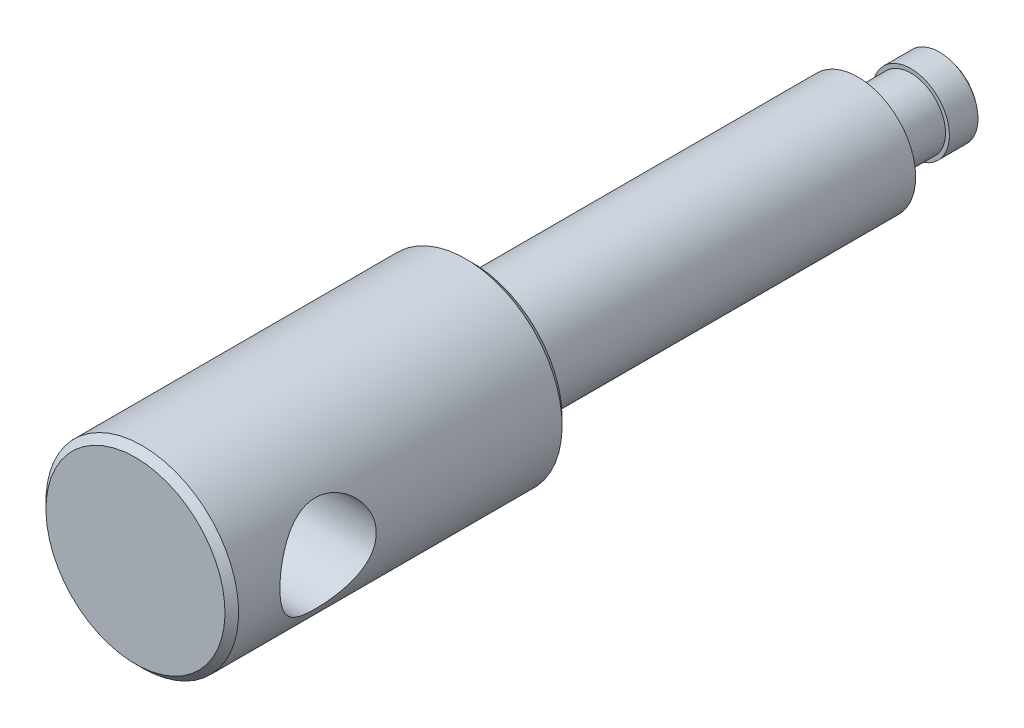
ISO-10303-21;
HEADER;
FILE_DESCRIPTION(('STEP AP214'),'2;1');
FILE_NAME('part.step','',(''),(''),'','','');
FILE_SCHEMA(('AUTOMOTIVE_DESIGN { 1 0 10303 214 1 1 1 1 }'));
ENDSEC;
DATA;
#1=APPLICATION_CONTEXT('core data for automotive mechanical design processes');
#2=APPLICATION_PROTOCOL_DEFINITION('international standard','automotive_design',2000,#1);
#3=PRODUCT_CONTEXT('',#1,'mechanical');
#4=PRODUCT('Part','Part','',(#3));
#5=PRODUCT_RELATED_PRODUCT_CATEGORY('part','',(#4));
#6=PRODUCT_DEFINITION_FORMATION('','',#4);
#7=PRODUCT_DEFINITION_CONTEXT('part definition',#1,'design');
#8=PRODUCT_DEFINITION('design','',#6,#7);
#9=PRODUCT_DEFINITION_SHAPE('','',#8);
#10=(LENGTH_UNIT() NAMED_UNIT(*) SI_UNIT(.MILLI.,.METRE.));
#11=(NAMED_UNIT(*) PLANE_ANGLE_UNIT() SI_UNIT($,.RADIAN.));
#12=(NAMED_UNIT(*) SI_UNIT($,.STERADIAN.) SOLID_ANGLE_UNIT());
#13=UNCERTAINTY_MEASURE_WITH_UNIT(LENGTH_MEASURE(1.E-05),#10,'distance_accuracy_value','');
#14=(GEOMETRIC_REPRESENTATION_CONTEXT(3) GLOBAL_UNCERTAINTY_ASSIGNED_CONTEXT((#13)) GLOBAL_UNIT_ASSIGNED_CONTEXT((#10,
#11,#12)) REPRESENTATION_CONTEXT('',''));
#15=CARTESIAN_POINT('',(0.,0.,0.));
#16=DIRECTION('',(0.,0.,1.));
#17=DIRECTION('',(1.,0.,0.));
#18=AXIS2_PLACEMENT_3D('',#15,#16,#17);
#19=CARTESIAN_POINT('',(0.,0.,6.));
#20=DIRECTION('',(-1.,0.,0.));
#21=DIRECTION('',(0.,1.,0.));
#22=AXIS2_PLACEMENT_3D('',#19,#20,#21);
#23=SPHERICAL_SURFACE('',#22,6.);
#24=CARTESIAN_POINT('',(0.,0.,1.52786404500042));
#25=DIRECTION('',(0.,0.,1.));
#26=DIRECTION('',(0.,-1.,0.));
#27=AXIS2_PLACEMENT_3D('',#24,#25,#26);
#28=CIRCLE('',#27,4.);
#29=CARTESIAN_POINT('',(0.,-4.,1.52786404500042));
#30=VERTEX_POINT('',#29);
#31=EDGE_CURVE('E112',#30,#30,#28,.T.);
#32=ORIENTED_EDGE('',*,*,#31,.F.);
#33=EDGE_LOOP('',(#32));
#34=FACE_BOUND('',#33,.T.);
#35=ADVANCED_FACE('F12',(#34),#23,.T.);
#36=CARTESIAN_POINT('',(0.,0.,0.));
#37=DIRECTION('',(0.,0.,1.));
#38=DIRECTION('',(0.,-1.,0.));
#39=AXIS2_PLACEMENT_3D('',#36,#37,#38);
#40=CYLINDRICAL_SURFACE('',#39,4.);
#41=CARTESIAN_POINT('',(0.,0.,4.5));
#42=DIRECTION('',(0.,0.,1.));
#43=DIRECTION('',(0.,-1.,0.));
#44=AXIS2_PLACEMENT_3D('',#41,#42,#43);
#45=CIRCLE('',#44,4.);
#46=CARTESIAN_POINT('',(0.,-4.,4.5));
#47=VERTEX_POINT('',#46);
#48=EDGE_CURVE('E113',#47,#47,#45,.F.);
#49=ORIENTED_EDGE('',*,*,#48,.T.);
#50=EDGE_LOOP('',(#49));
#51=FACE_BOUND('',#50,.T.);
#52=ORIENTED_EDGE('',*,*,#31,.T.);
#53=EDGE_LOOP('',(#52));
#54=FACE_BOUND('',#53,.T.);
#55=ADVANCED_FACE('F75',(#51,#54),#40,.T.);
#56=CARTESIAN_POINT('',(3.6,0.,4.5));
#57=DIRECTION('',(0.,0.,-1.));
#58=DIRECTION('',(0.,1.,0.));
#59=AXIS2_PLACEMENT_3D('',#56,#57,#58);
#60=PLANE('',#59);
#61=CARTESIAN_POINT('',(0.,0.,4.5));
#62=DIRECTION('',(0.,0.,1.));
#63=DIRECTION('',(0.,-1.,0.));
#64=AXIS2_PLACEMENT_3D('',#61,#62,#63);
#65=CIRCLE('',#64,3.6);
#66=CARTESIAN_POINT('',(0.,-3.6,4.5));
#67=VERTEX_POINT('',#66);
#68=EDGE_CURVE('E94',#67,#67,#65,.T.);
#69=ORIENTED_EDGE('',*,*,#68,.F.);
#70=EDGE_LOOP('',(#69));
#71=FACE_BOUND('',#70,.T.);
#72=ORIENTED_EDGE('',*,*,#48,.F.);
#73=EDGE_LOOP('',(#72));
#74=FACE_BOUND('',#73,.T.);
#75=ADVANCED_FACE('F71',(#71,#74),#60,.F.);
#76=CARTESIAN_POINT('',(0.,0.,0.));
#77=DIRECTION('',(0.,0.,1.));
#78=DIRECTION('',(0.,-1.,0.));
#79=AXIS2_PLACEMENT_3D('',#76,#77,#78);
#80=CYLINDRICAL_SURFACE('',#79,3.6);
#81=CARTESIAN_POINT('',(0.,0.,8.61435935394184));
#82=DIRECTION('',(0.,0.,1.));
#83=DIRECTION('',(0.,-1.,0.));
#84=AXIS2_PLACEMENT_3D('',#81,#82,#83);
#85=CIRCLE('',#84,3.59999999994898);
#86=CARTESIAN_POINT('',(0.,-3.59999999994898,8.61435935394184));
#87=VERTEX_POINT('',#86);
#88=EDGE_CURVE('E90',#87,#87,#85,.T.);
#89=ORIENTED_EDGE('',*,*,#88,.F.);
#90=EDGE_LOOP('',(#89));
#91=FACE_BOUND('',#90,.T.);
#92=ORIENTED_EDGE('',*,*,#68,.T.);
#93=EDGE_LOOP('',(#92));
#94=FACE_BOUND('',#93,.T.);
#95=ADVANCED_FACE('F67',(#91,#94),#80,.T.);
#96=CARTESIAN_POINT('',(0.,0.,9.99999999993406));
#97=DIRECTION('',(0.,0.,1.));
#98=DIRECTION('',(0.,-1.,0.));
#99=AXIS2_PLACEMENT_3D('',#96,#97,#98);
#100=CONICAL_SURFACE('',#99,5.99999999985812,1.04719755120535);
#101=CARTESIAN_POINT('',(0.,0.,10.));
#102=DIRECTION('',(0.,0.,1.));
#103=DIRECTION('',(0.,-1.,0.));
#104=AXIS2_PLACEMENT_3D('',#101,#102,#103);
#105=CIRCLE('',#104,6.);
#106=CARTESIAN_POINT('',(0.,-6.,10.));
#107=VERTEX_POINT('',#106);
#108=EDGE_CURVE('E97',#107,#107,#105,.T.);
#109=ORIENTED_EDGE('',*,*,#108,.F.);
#110=EDGE_LOOP('',(#109));
#111=FACE_BOUND('',#110,.T.);
#112=ORIENTED_EDGE('',*,*,#88,.T.);
#113=EDGE_LOOP('',(#112));
#114=FACE_BOUND('',#113,.T.);
#115=ADVANCED_FACE('F63',(#111,#114),#100,.T.);
#116=CARTESIAN_POINT('',(0.,0.,0.));
#117=DIRECTION('',(0.,0.,1.));
#118=DIRECTION('',(0.,-1.,0.));
#119=AXIS2_PLACEMENT_3D('',#116,#117,#118);
#120=CYLINDRICAL_SURFACE('',#119,6.);
#121=CARTESIAN_POINT('',(0.,0.,50.));
#122=DIRECTION('',(0.,0.,1.));
#123=DIRECTION('',(0.,-1.,0.));
#124=AXIS2_PLACEMENT_3D('',#121,#122,#123);
#125=CIRCLE('',#124,6.);
#126=CARTESIAN_POINT('',(0.,-6.,50.));
#127=VERTEX_POINT('',#126);
#128=EDGE_CURVE('E93',#127,#127,#125,.F.);
#129=ORIENTED_EDGE('',*,*,#128,.T.);
#130=EDGE_LOOP('',(#129));
#131=FACE_BOUND('',#130,.T.);
#132=ORIENTED_EDGE('',*,*,#108,.T.);
#133=EDGE_LOOP('',(#132));
#134=FACE_BOUND('',#133,.T.);
#135=ADVANCED_FACE('F59',(#131,#134),#120,.T.);
#136=CARTESIAN_POINT('',(9.29289321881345,0.,50.));
#137=DIRECTION('',(0.,0.,1.));
#138=DIRECTION('',(0.,-1.,0.));
#139=AXIS2_PLACEMENT_3D('',#136,#137,#138);
#140=PLANE('',#139);
#141=CARTESIAN_POINT('',(0.,0.,50.));
#142=DIRECTION('',(0.,0.,1.));
#143=DIRECTION('',(0.,-1.,0.));
#144=AXIS2_PLACEMENT_3D('',#141,#142,#143);
#145=CIRCLE('',#144,9.29289321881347);
#146=CARTESIAN_POINT('',(0.,-9.29289321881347,50.));
#147=VERTEX_POINT('',#146);
#148=EDGE_CURVE('E100',#147,#147,#145,.T.);
#149=ORIENTED_EDGE('',*,*,#148,.F.);
#150=EDGE_LOOP('',(#149));
#151=FACE_BOUND('',#150,.T.);
#152=ORIENTED_EDGE('',*,*,#128,.F.);
#153=EDGE_LOOP('',(#152));
#154=FACE_BOUND('',#153,.T.);
#155=ADVANCED_FACE('F55',(#151,#154),#140,.F.);
#156=CARTESIAN_POINT('',(0.,0.,85.));
#157=DIRECTION('',(0.,0.,-1.));
#158=DIRECTION('',(0.,1.,0.));
#159=AXIS2_PLACEMENT_3D('',#156,#157,#158);
#160=PLANE('',#159);
#161=CARTESIAN_POINT('',(0.,0.,85.));
#162=DIRECTION('',(0.,0.,-1.));
#163=DIRECTION('',(0.,1.,0.));
#164=AXIS2_PLACEMENT_3D('',#161,#162,#163);
#165=CIRCLE('',#164,9.29289321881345);
#166=CARTESIAN_POINT('',(0.,9.29289321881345,85.));
#167=VERTEX_POINT('',#166);
#168=EDGE_CURVE('E86',#167,#167,#165,.T.);
#169=ORIENTED_EDGE('',*,*,#168,.F.);
#170=EDGE_LOOP('',(#169));
#171=FACE_BOUND('',#170,.T.);
#172=ADVANCED_FACE('F51',(#171),#160,.F.);
#173=CARTESIAN_POINT('',(0.,0.,50.7071067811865));
#174=DIRECTION('',(0.,0.,1.));
#175=DIRECTION('',(0.,-1.,0.));
#176=AXIS2_PLACEMENT_3D('',#173,#174,#175);
#177=CONICAL_SURFACE('',#176,10.,0.785398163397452);
#178=CARTESIAN_POINT('',(0.,0.,50.7071067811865));
#179=DIRECTION('',(0.,0.,1.));
#180=DIRECTION('',(0.,-1.,0.));
#181=AXIS2_PLACEMENT_3D('',#178,#179,#180);
#182=CIRCLE('',#181,10.);
#183=CARTESIAN_POINT('',(0.,-10.,50.7071067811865));
#184=VERTEX_POINT('',#183);
#185=EDGE_CURVE('E27',#184,#184,#182,.T.);
#186=ORIENTED_EDGE('',*,*,#185,.F.);
#187=EDGE_LOOP('',(#186));
#188=FACE_BOUND('',#187,.T.);
#189=ORIENTED_EDGE('',*,*,#148,.T.);
#190=EDGE_LOOP('',(#189));
#191=FACE_BOUND('',#190,.T.);
#192=ADVANCED_FACE('F47',(#188,#191),#177,.T.);
#193=CARTESIAN_POINT('',(0.,0.,84.2928932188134));
#194=DIRECTION('',(0.,0.,-1.));
#195=DIRECTION('',(0.,1.,0.));
#196=AXIS2_PLACEMENT_3D('',#193,#194,#195);
#197=CONICAL_SURFACE('',#196,10.,0.78539816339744);
#198=ORIENTED_EDGE('',*,*,#168,.T.);
#199=EDGE_LOOP('',(#198));
#200=FACE_BOUND('',#199,.T.);
#201=CARTESIAN_POINT('',(0.,0.,84.2928932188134));
#202=DIRECTION('',(0.,0.,1.));
#203=DIRECTION('',(0.,-1.,0.));
#204=AXIS2_PLACEMENT_3D('',#201,#202,#203);
#205=CIRCLE('',#204,10.);
#206=CARTESIAN_POINT('',(0.,-10.,84.2928932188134));
#207=VERTEX_POINT('',#206);
#208=EDGE_CURVE('E31',#207,#207,#205,.F.);
#209=ORIENTED_EDGE('',*,*,#208,.F.);
#210=EDGE_LOOP('',(#209));
#211=FACE_BOUND('',#210,.T.);
#212=ADVANCED_FACE('F42',(#200,#211),#197,.T.);
#213=CARTESIAN_POINT('',(0.,0.,0.));
#214=DIRECTION('',(0.,0.,1.));
#215=DIRECTION('',(0.,-1.,0.));
#216=AXIS2_PLACEMENT_3D('',#213,#214,#215);
#217=CYLINDRICAL_SURFACE('',#216,10.);
#218=CARTESIAN_POINT('',(-8.66025403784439,5.,75.));
#219=CARTESIAN_POINT('',(-8.66025482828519,4.99999937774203,74.869668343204));
#220=CARTESIAN_POINT('',(-8.66320639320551,4.99489703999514,74.7393250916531));
#221=CARTESIAN_POINT('',(-8.67490215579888,4.97455590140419,74.4796447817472));
#222=CARTESIAN_POINT('',(-8.68364905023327,4.95931238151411,74.3503082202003));
#223=CARTESIAN_POINT('',(-8.70662912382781,4.91885673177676,74.0934864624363));
#224=CARTESIAN_POINT('',(-8.72087090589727,4.89362896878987,73.966004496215));
#225=CARTESIAN_POINT('',(-8.75432466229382,4.83352579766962,73.7139825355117));
#226=CARTESIAN_POINT('',(-8.77353879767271,4.79864619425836,73.589443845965));
#227=CARTESIAN_POINT('',(-8.83745677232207,4.6805346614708,73.2228887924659));
#228=CARTESIAN_POINT('',(-8.88859880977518,4.58356144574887,72.9862676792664));
#229=CARTESIAN_POINT('',(-9.00213659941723,4.35632594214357,72.5328380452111));
#230=CARTESIAN_POINT('',(-9.06453296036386,4.22606185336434,72.3160305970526));
#231=CARTESIAN_POINT('',(-9.19984032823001,3.92334549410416,71.8884893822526));
#232=CARTESIAN_POINT('',(-9.27319410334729,3.74829976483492,71.6797314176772));
#233=CARTESIAN_POINT('',(-9.41860822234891,3.36622943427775,71.2929309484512));
#234=CARTESIAN_POINT('',(-9.49066790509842,3.15918897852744,71.1149037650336));
#235=CARTESIAN_POINT('',(-9.59484443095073,2.82033206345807,70.8687735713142));
#236=CARTESIAN_POINT('',(-9.62993554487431,2.69838192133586,70.7880868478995));
#237=CARTESIAN_POINT('',(-9.69680156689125,2.44722131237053,70.6373713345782));
#238=CARTESIAN_POINT('',(-9.72857779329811,2.31801376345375,70.5673383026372));
#239=CARTESIAN_POINT('',(-9.78789520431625,2.05317391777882,70.4386237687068));
#240=CARTESIAN_POINT('',(-9.81543747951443,1.91754328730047,70.3799393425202));
#241=CARTESIAN_POINT('',(-9.86547242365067,1.64079696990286,70.2745689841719));
#242=CARTESIAN_POINT('',(-9.88796562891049,1.49968186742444,70.2278817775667));
#243=CARTESIAN_POINT('',(-9.92580359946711,1.22330436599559,70.1499844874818));
#244=CARTESIAN_POINT('',(-9.94154295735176,1.08833937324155,70.1179098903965));
#245=CARTESIAN_POINT('',(-9.96761571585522,0.815709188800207,70.0650335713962));
#246=CARTESIAN_POINT('',(-9.97794964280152,0.678044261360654,70.0442307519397));
#247=CARTESIAN_POINT('',(-9.99290900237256,0.401217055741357,70.0141800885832));
#248=CARTESIAN_POINT('',(-9.99753719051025,0.262055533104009,70.0049266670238));
#249=CARTESIAN_POINT('',(-10.0009568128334,-0.0166220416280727,69.9980856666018));
#250=CARTESIAN_POINT('',(-9.99974860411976,-0.156138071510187,70.0004973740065));
#251=CARTESIAN_POINT('',(-9.99189263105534,-0.422158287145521,70.0162306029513));
#252=CARTESIAN_POINT('',(-9.9857287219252,-0.548735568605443,70.0285817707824));
#253=CARTESIAN_POINT('',(-9.9687211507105,-0.800312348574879,70.0628325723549));
#254=CARTESIAN_POINT('',(-9.95787601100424,-0.925311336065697,70.084735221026));
#255=CARTESIAN_POINT('',(-9.93176736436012,-1.17280363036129,70.1378462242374));
#256=CARTESIAN_POINT('',(-9.91650533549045,-1.29529776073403,70.1690514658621));
#257=CARTESIAN_POINT('',(-9.88192155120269,-1.53706747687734,70.2404476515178));
#258=CARTESIAN_POINT('',(-9.86259824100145,-1.65634181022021,70.2806420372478));
#259=CARTESIAN_POINT('',(-9.79859222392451,-2.01140340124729,70.4153745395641));
#260=CARTESIAN_POINT('',(-9.74822622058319,-2.24122720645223,70.5233689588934));
#261=CARTESIAN_POINT('',(-9.63687815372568,-2.67992393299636,70.7713296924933));
#262=CARTESIAN_POINT('',(-9.57589229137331,-2.88878931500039,70.911307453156));
#263=CARTESIAN_POINT('',(-9.44222356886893,-3.30085071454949,71.2344634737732));
#264=CARTESIAN_POINT('',(-9.36897995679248,-3.5016445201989,71.4204746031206));
#265=CARTESIAN_POINT('',(-9.22270586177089,-3.87054772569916,71.8229891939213));
#266=CARTESIAN_POINT('',(-9.14967558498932,-4.03863197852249,72.0395158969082));
#267=CARTESIAN_POINT('',(-9.04390911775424,-4.26795395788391,72.3911935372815));
#268=CARTESIAN_POINT('',(-9.00829977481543,-4.34240098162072,72.5170509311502));
#269=CARTESIAN_POINT('',(-8.94051483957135,-4.48030007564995,72.7755138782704));
#270=CARTESIAN_POINT('',(-8.90833780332,-4.54375677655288,72.9081165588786));
#271=CARTESIAN_POINT('',(-8.84860631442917,-4.65901104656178,73.1792034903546));
#272=CARTESIAN_POINT('',(-8.82104906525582,-4.71081567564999,73.3176841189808));
#273=CARTESIAN_POINT('',(-8.7716484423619,-4.80217514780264,73.5996213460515));
#274=CARTESIAN_POINT('',(-8.74980428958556,-4.84173166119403,73.7430772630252));
#275=CARTESIAN_POINT('',(-8.71426171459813,-4.90539138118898,74.0222569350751));
#276=CARTESIAN_POINT('',(-8.7000553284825,-4.93047005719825,74.1576937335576));
#277=CARTESIAN_POINT('',(-8.67788216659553,-4.96939299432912,74.4306719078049));
#278=CARTESIAN_POINT('',(-8.66991462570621,-4.98323863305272,74.5682130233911));
#279=CARTESIAN_POINT('',(-8.66056020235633,-4.99947854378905,74.8441154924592));
#280=CARTESIAN_POINT('',(-8.65916956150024,-5.0018793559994,74.98247633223));
#281=CARTESIAN_POINT('',(-8.66301922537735,-4.99520900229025,75.2588209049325));
#282=CARTESIAN_POINT('',(-8.66825908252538,-4.98613861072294,75.3968046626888));
#283=CARTESIAN_POINT('',(-8.68421505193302,-4.95828928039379,75.6560880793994));
#284=CARTESIAN_POINT('',(-8.69426699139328,-4.94068517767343,75.7775567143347));
#285=CARTESIAN_POINT('',(-8.71910498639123,-4.8967167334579,76.0184175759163));
#286=CARTESIAN_POINT('',(-8.73389250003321,-4.87034969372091,76.1378091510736));
#287=CARTESIAN_POINT('',(-8.7846960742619,-4.77850297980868,76.4917100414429));
#288=CARTESIAN_POINT('',(-8.82716454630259,-4.7002591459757,76.7221142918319));
#289=CARTESIAN_POINT('',(-8.92681241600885,-4.50823244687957,77.1770932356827));
#290=CARTESIAN_POINT('',(-8.98458205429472,-4.392971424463,77.4009036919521));
#291=CARTESIAN_POINT('',(-9.10780608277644,-4.13143421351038,77.8273377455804));
#292=CARTESIAN_POINT('',(-9.1732644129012,-3.98514209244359,78.0299503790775));
#293=CARTESIAN_POINT('',(-9.31439795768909,-3.64419701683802,78.4348914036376));
#294=CARTESIAN_POINT('',(-9.39032093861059,-3.44577250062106,78.6339644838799));
#295=CARTESIAN_POINT('',(-9.53671997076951,-3.01697632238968,78.9970824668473));
#296=CARTESIAN_POINT('',(-9.60719417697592,-2.78659391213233,79.1611155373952));
#297=CARTESIAN_POINT('',(-9.7041941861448,-2.41774074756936,79.3790094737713));
#298=CARTESIAN_POINT('',(-9.73542921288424,-2.28903769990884,79.4476620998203));
#299=CARTESIAN_POINT('',(-9.79367711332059,-2.02535752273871,79.5737565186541));
#300=CARTESIAN_POINT('',(-9.82069185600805,-1.89038320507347,79.6312032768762));
#301=CARTESIAN_POINT('',(-9.86968940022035,-1.61516754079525,79.7342179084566));
#302=CARTESIAN_POINT('',(-9.89167460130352,-1.47492874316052,79.7797914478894));
#303=CARTESIAN_POINT('',(-9.92995088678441,-1.19024723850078,79.8585090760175));
#304=CARTESIAN_POINT('',(-9.94624264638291,-1.04580503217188,79.8916546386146));
#305=CARTESIAN_POINT('',(-9.97139931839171,-0.767401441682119,79.9425950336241));
#306=CARTESIAN_POINT('',(-9.98080865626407,-0.633694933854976,79.9615196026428));
#307=CARTESIAN_POINT('',(-9.99424478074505,-0.364924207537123,79.9884934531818));
#308=CARTESIAN_POINT('',(-9.9982719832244,-0.229860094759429,79.9965435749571));
#309=CARTESIAN_POINT('',(-10.0008314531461,0.0404881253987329,80.0016631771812));
#310=CARTESIAN_POINT('',(-9.999365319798,0.175772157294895,79.9987358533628));
#311=CARTESIAN_POINT('',(-9.99098333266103,0.445485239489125,79.9819474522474));
#312=CARTESIAN_POINT('',(-9.98406762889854,0.579914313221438,79.9680866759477));
#313=CARTESIAN_POINT('',(-9.96560870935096,0.838004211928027,79.9308823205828));
#314=CARTESIAN_POINT('',(-9.95440210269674,0.961788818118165,79.9082271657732));
#315=CARTESIAN_POINT('',(-9.92767317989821,1.20687032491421,79.8537868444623));
#316=CARTESIAN_POINT('',(-9.91214948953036,1.32816642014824,79.8219987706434));
#317=CARTESIAN_POINT('',(-9.859612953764,1.68709586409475,79.7133917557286));
#318=CARTESIAN_POINT('',(-9.81661817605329,1.91998814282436,79.6232980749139));
#319=CARTESIAN_POINT('',(-9.71629432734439,2.37715486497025,79.4063577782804));
#320=CARTESIAN_POINT('',(-9.65843082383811,2.60063468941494,79.2781040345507));
#321=CARTESIAN_POINT('',(-9.53440669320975,3.02386422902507,78.9902096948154));
#322=CARTESIAN_POINT('',(-9.46824226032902,3.22360297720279,78.8305546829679));
#323=CARTESIAN_POINT('',(-9.32643278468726,3.61456788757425,78.4660248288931));
#324=CARTESIAN_POINT('',(-9.25049954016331,3.80296860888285,78.2582309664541));
#325=CARTESIAN_POINT('',(-9.1031442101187,4.14333626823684,77.8127029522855));
#326=CARTESIAN_POINT('',(-9.03172615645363,4.29527097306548,77.5749425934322));
#327=CARTESIAN_POINT('',(-8.93341291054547,4.49442606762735,77.1957803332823));
#328=CARTESIAN_POINT('',(-8.90168698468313,4.55675683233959,77.063373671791));
#329=CARTESIAN_POINT('',(-8.84287972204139,4.6698542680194,76.7927445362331));
#330=CARTESIAN_POINT('',(-8.81579599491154,4.7206268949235,76.6545251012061));
#331=CARTESIAN_POINT('',(-8.76742025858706,4.80987708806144,76.3735921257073));
#332=CARTESIAN_POINT('',(-8.74611337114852,4.8483862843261,76.2308912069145));
#333=CARTESIAN_POINT('',(-8.71014784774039,4.91270711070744,75.9419078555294));
#334=CARTESIAN_POINT('',(-8.69548456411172,4.93852761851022,75.7956280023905));
#335=CARTESIAN_POINT('',(-8.67647541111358,4.97182308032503,75.5410021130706));
#336=CARTESIAN_POINT('',(-8.67040719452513,4.98237929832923,75.4331757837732));
#337=CARTESIAN_POINT('',(-8.66229604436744,4.99646825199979,75.2169023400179));
#338=CARTESIAN_POINT('',(-8.66025338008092,5.00000051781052,75.1084551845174));
#339=CARTESIAN_POINT('',(-8.66025403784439,5.,75.));
#340=B_SPLINE_CURVE_WITH_KNOTS('',3,(#218,#219,#220,#221,#222,#223,#224,#225,#226,#227,#228,
#229,#230,#231,#232,#233,#234,#235,#236,#237,#238,#239,#240,#241,#242,#243,#244,#245,#246,#247,
#248,#249,#250,#251,#252,#253,#254,#255,#256,#257,#258,#259,#260,#261,#262,#263,#264,#265,#266,
#267,#268,#269,#270,#271,#272,#273,#274,#275,#276,#277,#278,#279,#280,#281,#282,#283,#284,#285,
#286,#287,#288,#289,#290,#291,#292,#293,#294,#295,#296,#297,#298,#299,#300,#301,#302,#303,#304,
#305,#306,#307,#308,#309,#310,#311,#312,#313,#314,#315,#316,#317,#318,#319,#320,#321,#322,#323,
#324,#325,#326,#327,#328,#329,#330,#331,#332,#333,#334,#335,#336,#337,#338,#339),.UNSPECIFIED.,
.T.,.F.,(4,2,2,2,2,2,2,2,2,2,2,2,2,2,2,2,2,2,2,2,2,2,2,2,2,2,2,2,2,2,2,2,2,2,2,2,2,2,2,2,2,2,2,
2,2,2,2,2,2,2,2,2,2,2,2,2,2,2,2,2,4),(0.,0.390882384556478,0.781946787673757,1.17362595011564,
1.56547562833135,2.34415414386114,3.12287479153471,3.96582272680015,4.80918971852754,
5.25982992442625,5.71029022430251,6.16063429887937,6.61093051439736,7.02920538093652,
7.44743951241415,7.86547158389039,8.28347807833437,8.66500933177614,9.0466611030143,
9.42818530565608,9.80985583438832,10.5829669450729,11.3563551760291,12.202849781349,
13.0499926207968,13.501002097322,13.9518210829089,14.4023661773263,14.8528498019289,
15.2676702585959,15.6824398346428,16.0969723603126,16.5114769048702,16.8804871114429,
17.2496110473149,17.9873544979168,18.759266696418,19.5315761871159,20.4012390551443,
21.2711951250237,21.7182117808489,22.1650299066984,22.6116344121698,23.0581859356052,
23.4637505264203,23.8692837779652,24.2746989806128,24.6801030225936,25.0586722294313,
25.4373620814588,26.1940875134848,26.9831783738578,27.7726323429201,28.6406529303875,
29.5094379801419,29.9581473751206,30.4066250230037,30.8539364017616,31.3009343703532,
31.626184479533,31.9514563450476),.UNSPECIFIED.);
#341=CARTESIAN_POINT('',(-8.66025403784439,5.,75.));
#342=VERTEX_POINT('',#341);
#343=EDGE_CURVE('E23',#342,#342,#340,.T.);
#344=ORIENTED_EDGE('',*,*,#343,.F.);
#345=EDGE_LOOP('',(#344));
#346=FACE_BOUND('',#345,.T.);
#347=ORIENTED_EDGE('',*,*,#208,.T.);
#348=EDGE_LOOP('',(#347));
#349=FACE_BOUND('',#348,.T.);
#350=CARTESIAN_POINT('',(8.66025403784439,5.,75.));
#351=CARTESIAN_POINT('',(8.66025482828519,4.99999937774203,75.130331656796));
#352=CARTESIAN_POINT('',(8.66320639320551,4.99489703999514,75.2606749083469));
#353=CARTESIAN_POINT('',(8.67490215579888,4.97455590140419,75.5203552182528));
#354=CARTESIAN_POINT('',(8.68364905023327,4.95931238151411,75.6496917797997));
#355=CARTESIAN_POINT('',(8.70662912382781,4.91885673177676,75.9065135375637));
#356=CARTESIAN_POINT('',(8.72087090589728,4.89362896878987,76.033995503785));
#357=CARTESIAN_POINT('',(8.75432466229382,4.83352579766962,76.2860174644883));
#358=CARTESIAN_POINT('',(8.77353879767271,4.79864619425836,76.410556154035));
#359=CARTESIAN_POINT('',(8.83745677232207,4.6805346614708,76.7771112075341));
#360=CARTESIAN_POINT('',(8.88859880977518,4.58356144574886,77.0137323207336));
#361=CARTESIAN_POINT('',(9.00213659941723,4.35632594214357,77.4671619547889));
#362=CARTESIAN_POINT('',(9.06453296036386,4.22606185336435,77.6839694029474));
#363=CARTESIAN_POINT('',(9.19984032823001,3.92334549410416,78.1115106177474));
#364=CARTESIAN_POINT('',(9.27319410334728,3.74829976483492,78.3202685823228));
#365=CARTESIAN_POINT('',(9.41860822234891,3.36622943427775,78.7070690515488));
#366=CARTESIAN_POINT('',(9.49066790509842,3.15918897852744,78.8850962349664));
#367=CARTESIAN_POINT('',(9.59484443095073,2.82033206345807,79.1312264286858));
#368=CARTESIAN_POINT('',(9.62993554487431,2.69838192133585,79.2119131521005));
#369=CARTESIAN_POINT('',(9.69680156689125,2.44722131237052,79.3626286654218));
#370=CARTESIAN_POINT('',(9.72857779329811,2.31801376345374,79.4326616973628));
#371=CARTESIAN_POINT('',(9.78789520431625,2.05317391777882,79.5613762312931));
#372=CARTESIAN_POINT('',(9.81543747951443,1.91754328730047,79.6200606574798));
#373=CARTESIAN_POINT('',(9.86547242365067,1.64079696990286,79.7254310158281));
#374=CARTESIAN_POINT('',(9.88796562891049,1.49968186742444,79.7721182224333));
#375=CARTESIAN_POINT('',(9.92580359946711,1.22330436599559,79.8500155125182));
#376=CARTESIAN_POINT('',(9.94154295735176,1.08833937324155,79.8820901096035));
#377=CARTESIAN_POINT('',(9.96761571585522,0.815709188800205,79.9349664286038));
#378=CARTESIAN_POINT('',(9.97794964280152,0.678044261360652,79.9557692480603));
#379=CARTESIAN_POINT('',(9.99290900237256,0.401217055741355,79.9858199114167));
#380=CARTESIAN_POINT('',(9.99753719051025,0.262055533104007,79.9950733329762));
#381=CARTESIAN_POINT('',(10.0009568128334,-0.0166220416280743,80.0019143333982));
#382=CARTESIAN_POINT('',(9.99974860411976,-0.156138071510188,79.9995026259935));
#383=CARTESIAN_POINT('',(9.99189263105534,-0.422158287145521,79.9837693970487));
#384=CARTESIAN_POINT('',(9.9857287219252,-0.548735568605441,79.9714182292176));
#385=CARTESIAN_POINT('',(9.9687211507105,-0.800312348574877,79.937167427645));
#386=CARTESIAN_POINT('',(9.95787601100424,-0.925311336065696,79.915264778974));
#387=CARTESIAN_POINT('',(9.93176736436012,-1.17280363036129,79.8621537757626));
#388=CARTESIAN_POINT('',(9.91650533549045,-1.29529776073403,79.8309485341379));
#389=CARTESIAN_POINT('',(9.88192155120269,-1.53706747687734,79.7595523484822));
#390=CARTESIAN_POINT('',(9.86259824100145,-1.6563418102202,79.7193579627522));
#391=CARTESIAN_POINT('',(9.79859222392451,-2.01140340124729,79.5846254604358));
#392=CARTESIAN_POINT('',(9.74822622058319,-2.24122720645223,79.4766310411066));
#393=CARTESIAN_POINT('',(9.63687815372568,-2.67992393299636,79.2286703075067));
#394=CARTESIAN_POINT('',(9.57589229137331,-2.88878931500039,79.088692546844));
#395=CARTESIAN_POINT('',(9.44222356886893,-3.30085071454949,78.7655365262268));
#396=CARTESIAN_POINT('',(9.36897995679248,-3.5016445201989,78.5795253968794));
#397=CARTESIAN_POINT('',(9.22270586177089,-3.87054772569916,78.1770108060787));
#398=CARTESIAN_POINT('',(9.14967558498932,-4.03863197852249,77.9604841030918));
#399=CARTESIAN_POINT('',(9.04390911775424,-4.26795395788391,77.6088064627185));
#400=CARTESIAN_POINT('',(9.00829977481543,-4.34240098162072,77.4829490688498));
#401=CARTESIAN_POINT('',(8.94051483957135,-4.48030007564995,77.2244861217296));
#402=CARTESIAN_POINT('',(8.90833780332,-4.54375677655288,77.0918834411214));
#403=CARTESIAN_POINT('',(8.84860631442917,-4.65901104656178,76.8207965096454));
#404=CARTESIAN_POINT('',(8.82104906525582,-4.71081567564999,76.6823158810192));
#405=CARTESIAN_POINT('',(8.7716484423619,-4.80217514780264,76.4003786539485));
#406=CARTESIAN_POINT('',(8.74980428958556,-4.84173166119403,76.2569227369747));
#407=CARTESIAN_POINT('',(8.71426171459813,-4.90539138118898,75.9777430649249));
#408=CARTESIAN_POINT('',(8.7000553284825,-4.93047005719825,75.8423062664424));
#409=CARTESIAN_POINT('',(8.67788216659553,-4.96939299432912,75.5693280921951));
#410=CARTESIAN_POINT('',(8.66991462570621,-4.98323863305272,75.4317869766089));
#411=CARTESIAN_POINT('',(8.66056020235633,-4.99947854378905,75.1558845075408));
#412=CARTESIAN_POINT('',(8.65916956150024,-5.0018793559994,75.01752366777));
#413=CARTESIAN_POINT('',(8.66301922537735,-4.99520900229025,74.7411790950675));
#414=CARTESIAN_POINT('',(8.66825908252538,-4.98613861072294,74.6031953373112));
#415=CARTESIAN_POINT('',(8.68421505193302,-4.95828928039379,74.3439119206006));
#416=CARTESIAN_POINT('',(8.69426699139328,-4.94068517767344,74.2224432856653));
#417=CARTESIAN_POINT('',(8.71910498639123,-4.8967167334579,73.9815824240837));
#418=CARTESIAN_POINT('',(8.73389250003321,-4.87034969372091,73.8621908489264));
#419=CARTESIAN_POINT('',(8.7846960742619,-4.77850297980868,73.5082899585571));
#420=CARTESIAN_POINT('',(8.82716454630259,-4.7002591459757,73.2778857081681));
#421=CARTESIAN_POINT('',(8.92681241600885,-4.50823244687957,72.8229067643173));
#422=CARTESIAN_POINT('',(8.98458205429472,-4.392971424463,72.5990963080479));
#423=CARTESIAN_POINT('',(9.10780608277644,-4.13143421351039,72.1726622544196));
#424=CARTESIAN_POINT('',(9.1732644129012,-3.98514209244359,71.9700496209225));
#425=CARTESIAN_POINT('',(9.31439795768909,-3.64419701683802,71.5651085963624));
#426=CARTESIAN_POINT('',(9.39032093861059,-3.44577250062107,71.3660355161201));
#427=CARTESIAN_POINT('',(9.53671997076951,-3.01697632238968,71.0029175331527));
#428=CARTESIAN_POINT('',(9.60719417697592,-2.78659391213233,70.8388844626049));
#429=CARTESIAN_POINT('',(9.70419418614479,-2.41774074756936,70.6209905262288));
#430=CARTESIAN_POINT('',(9.73542921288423,-2.28903769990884,70.5523379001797));
#431=CARTESIAN_POINT('',(9.79367711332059,-2.02535752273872,70.4262434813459));
#432=CARTESIAN_POINT('',(9.82069185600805,-1.89038320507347,70.3687967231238));
#433=CARTESIAN_POINT('',(9.86968940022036,-1.61516754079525,70.2657820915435));
#434=CARTESIAN_POINT('',(9.89167460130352,-1.47492874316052,70.2202085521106));
#435=CARTESIAN_POINT('',(9.92995088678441,-1.19024723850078,70.1414909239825));
#436=CARTESIAN_POINT('',(9.94624264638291,-1.04580503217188,70.1083453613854));
#437=CARTESIAN_POINT('',(9.97139931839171,-0.767401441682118,70.0574049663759));
#438=CARTESIAN_POINT('',(9.98080865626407,-0.633694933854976,70.0384803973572));
#439=CARTESIAN_POINT('',(9.99424478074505,-0.364924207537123,70.0115065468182));
#440=CARTESIAN_POINT('',(9.9982719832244,-0.22986009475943,70.0034564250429));
#441=CARTESIAN_POINT('',(10.0008314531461,0.0404881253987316,69.9983368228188));
#442=CARTESIAN_POINT('',(9.999365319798,0.175772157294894,70.0012641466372));
#443=CARTESIAN_POINT('',(9.99098333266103,0.445485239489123,70.0180525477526));
#444=CARTESIAN_POINT('',(9.98406762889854,0.579914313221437,70.0319133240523));
#445=CARTESIAN_POINT('',(9.96560870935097,0.838004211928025,70.0691176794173));
#446=CARTESIAN_POINT('',(9.95440210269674,0.961788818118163,70.0917728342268));
#447=CARTESIAN_POINT('',(9.92767317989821,1.20687032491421,70.1462131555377));
#448=CARTESIAN_POINT('',(9.91214948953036,1.32816642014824,70.1780012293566));
#449=CARTESIAN_POINT('',(9.859612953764,1.68709586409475,70.2866082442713));
#450=CARTESIAN_POINT('',(9.8166181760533,1.91998814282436,70.3767019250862));
#451=CARTESIAN_POINT('',(9.71629432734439,2.37715486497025,70.5936422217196));
#452=CARTESIAN_POINT('',(9.65843082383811,2.60063468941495,70.7218959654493));
#453=CARTESIAN_POINT('',(9.53440669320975,3.02386422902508,71.0097903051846));
#454=CARTESIAN_POINT('',(9.46824226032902,3.22360297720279,71.1694453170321));
#455=CARTESIAN_POINT('',(9.32643278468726,3.61456788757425,71.5339751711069));
#456=CARTESIAN_POINT('',(9.2504995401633,3.80296860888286,71.7417690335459));
#457=CARTESIAN_POINT('',(9.10314421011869,4.14333626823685,72.1872970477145));
#458=CARTESIAN_POINT('',(9.03172615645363,4.29527097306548,72.4250574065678));
#459=CARTESIAN_POINT('',(8.93341291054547,4.49442606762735,72.8042196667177));
#460=CARTESIAN_POINT('',(8.90168698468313,4.55675683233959,72.936626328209));
#461=CARTESIAN_POINT('',(8.84287972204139,4.6698542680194,73.2072554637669));
#462=CARTESIAN_POINT('',(8.81579599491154,4.7206268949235,73.3454748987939));
#463=CARTESIAN_POINT('',(8.76742025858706,4.80987708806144,73.6264078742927));
#464=CARTESIAN_POINT('',(8.74611337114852,4.8483862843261,73.7691087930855));
#465=CARTESIAN_POINT('',(8.71014784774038,4.91270711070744,74.0580921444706));
#466=CARTESIAN_POINT('',(8.69548456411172,4.93852761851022,74.2043719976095));
#467=CARTESIAN_POINT('',(8.67647541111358,4.97182308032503,74.4589978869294));
#468=CARTESIAN_POINT('',(8.67040719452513,4.98237929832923,74.5668242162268));
#469=CARTESIAN_POINT('',(8.66229604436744,4.99646825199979,74.7830976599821));
#470=CARTESIAN_POINT('',(8.66025338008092,5.00000051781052,74.8915448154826));
#471=CARTESIAN_POINT('',(8.66025403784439,5.,75.));
#472=B_SPLINE_CURVE_WITH_KNOTS('',3,(#350,#351,#352,#353,#354,#355,#356,#357,#358,#359,#360,
#361,#362,#363,#364,#365,#366,#367,#368,#369,#370,#371,#372,#373,#374,#375,#376,#377,#378,#379,
#380,#381,#382,#383,#384,#385,#386,#387,#388,#389,#390,#391,#392,#393,#394,#395,#396,#397,#398,
#399,#400,#401,#402,#403,#404,#405,#406,#407,#408,#409,#410,#411,#412,#413,#414,#415,#416,#417,
#418,#419,#420,#421,#422,#423,#424,#425,#426,#427,#428,#429,#430,#431,#432,#433,#434,#435,#436,
#437,#438,#439,#440,#441,#442,#443,#444,#445,#446,#447,#448,#449,#450,#451,#452,#453,#454,#455,
#456,#457,#458,#459,#460,#461,#462,#463,#464,#465,#466,#467,#468,#469,#470,#471),.UNSPECIFIED.,
.T.,.F.,(4,2,2,2,2,2,2,2,2,2,2,2,2,2,2,2,2,2,2,2,2,2,2,2,2,2,2,2,2,2,2,2,2,2,2,2,2,2,2,2,2,2,2,
2,2,2,2,2,2,2,2,2,2,2,2,2,2,2,2,2,4),(0.,0.390882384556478,0.781946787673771,1.17362595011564,
1.56547562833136,2.34415414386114,3.12287479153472,3.96582272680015,4.80918971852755,
5.25982992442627,5.71029022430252,6.16063429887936,6.61093051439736,7.02920538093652,
7.44743951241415,7.86547158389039,8.28347807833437,8.66500933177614,9.0466611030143,
9.42818530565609,9.80985583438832,10.5829669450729,11.3563551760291,12.202849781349,
13.0499926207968,13.501002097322,13.9518210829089,14.4023661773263,14.8528498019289,
15.2676702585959,15.6824398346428,16.0969723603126,16.5114769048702,16.8804871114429,
17.2496110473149,17.9873544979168,18.759266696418,19.5315761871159,20.4012390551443,
21.2711951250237,21.7182117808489,22.1650299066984,22.6116344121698,23.0581859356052,
23.4637505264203,23.8692837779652,24.2746989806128,24.6801030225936,25.0586722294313,
25.4373620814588,26.1940875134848,26.9831783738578,27.7726323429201,28.6406529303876,
29.5094379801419,29.9581473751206,30.4066250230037,30.8539364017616,31.3009343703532,
31.6261844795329,31.9514563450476),.UNSPECIFIED.);
#473=CARTESIAN_POINT('',(8.66025403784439,5.,75.));
#474=VERTEX_POINT('',#473);
#475=EDGE_CURVE('E8',#474,#474,#472,.T.);
#476=ORIENTED_EDGE('',*,*,#475,.F.);
#477=EDGE_LOOP('',(#476));
#478=FACE_BOUND('',#477,.T.);
#479=ORIENTED_EDGE('',*,*,#185,.T.);
#480=EDGE_LOOP('',(#479));
#481=FACE_BOUND('',#480,.T.);
#482=ADVANCED_FACE('F38',(#346,#349,#478,#481),#217,.T.);
#483=CARTESIAN_POINT('',(-20.0022539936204,0.,75.));
#484=DIRECTION('',(1.,0.,0.));
#485=DIRECTION('',(0.,1.,0.));
#486=AXIS2_PLACEMENT_3D('',#483,#484,#485);
#487=CYLINDRICAL_SURFACE('',#486,5.);
#488=ORIENTED_EDGE('',*,*,#343,.T.);
#489=EDGE_LOOP('',(#488));
#490=FACE_BOUND('',#489,.T.);
#491=ORIENTED_EDGE('',*,*,#475,.T.);
#492=EDGE_LOOP('',(#491));
#493=FACE_BOUND('',#492,.T.);
#494=ADVANCED_FACE('F14',(#490,#493),#487,.F.);
#495=CLOSED_SHELL('',(#35,#55,#75,#95,#115,#135,#155,#172,#192,#212,#482,#494));
#496=MANIFOLD_SOLID_BREP('B1',#495);
#497=ADVANCED_BREP_SHAPE_REPRESENTATION('',(#18,#496),#14);
#498=SHAPE_DEFINITION_REPRESENTATION(#9,#497);
ENDSEC;
END-ISO-10303-21;
